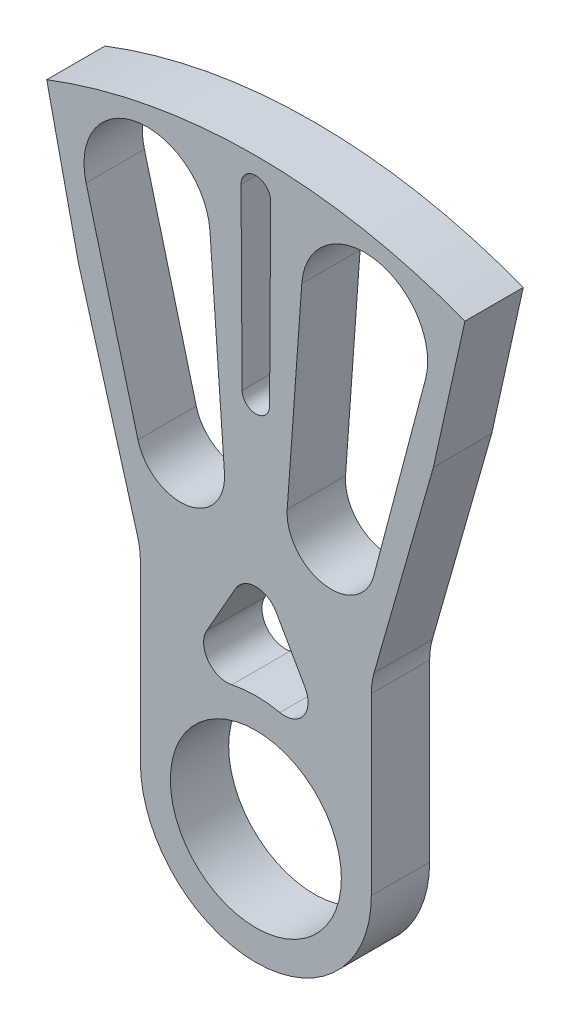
from build123d import *

# Parameters (mm, degrees)
SKETCH2_R          = 9.398
EXTRUDE1_DEPTH     = 3.175
SKETCH8_R          = 9.3091
EXTRUDE2_DEPTH     = 6.35
CUT_EXTRUDE4_DEPTH = 68.756510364
CUT_EXTRUDE5_DEPTH = 68.756510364
CUT_EXTRUDE6_DEPTH = 68.756510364


with BuildPart() as part:
    # Sketch2 → Extrude1 (new, symmetric)
    with BuildSketch(Plane.XY):
        with BuildLine():
            Line((12.573, 13.292251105), (12.573, 0))
            ThreePointArc((12.573, 0), (0, -12.573), (-12.573, 0))
            Line((-12.573, 0), (-12.573, 13.292251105))
            Line((-12.573, 13.292251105), (-22.767788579, 59.27797064))
            ThreePointArc((-22.767788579, 59.27797064), (0, 63.5), (22.767788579, 59.27797064))
            Line((22.767788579, 59.27797064), (12.573, 13.292251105))
        make_face()
        Circle(SKETCH2_R, mode=Mode.SUBTRACT)
    extrude(amount=EXTRUDE1_DEPTH, both=True)

    # Sketch8 → Extrude2 (add)
    with BuildSketch(Plane(origin=(0, 0, -3.175), x_dir=(-1, 0, 0), z_dir=(0, 0, -1))):
        with BuildLine():
            ThreePointArc((-9.398, 0), (0, -9.398), (9.398, 0))
            ThreePointArc((9.398, 0), (0, 9.398), (-9.398, 0))
        make_face()
        Circle(SKETCH8_R, mode=Mode.SUBTRACT)
    extrude(amount=-EXTRUDE2_DEPTH)

    # Sketch9 → Cut-Extrude4 (cut, through all)
    with BuildSketch(Plane.XY.offset(3.175)):
        with BuildLine():
            Line((12.573, 13.292251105), (12.573, 19.05))
            ThreePointArc((12.573, 19.05), (12.646614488, 20.106629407), (12.866035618, 21.142843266))
            Line((12.866035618, 21.142843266), (19.331809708, 43.779271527))
            Line((19.331809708, 43.779271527), (12.573, 13.292251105))
        make_face()
        with BuildLine():
            Line((-12.573, 13.292251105), (-12.573, 19.05))
            ThreePointArc((-12.573, 19.05), (-12.646614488, 20.106629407), (-12.866035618, 21.142843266))
            Line((-12.866035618, 21.142843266), (-19.331809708, 43.779271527))
            Line((-19.331809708, 43.779271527), (-12.573, 13.292251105))
        make_face()
    extrude(amount=-CUT_EXTRUDE4_DEPTH, mode=Mode.SUBTRACT)

    # Sketch10 → Cut-Extrude5 (cut, through all)
    with BuildSketch(Plane.XY.offset(3.175)):
        with BuildLine():
            Line((5.000258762, 53.925776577), (3.415349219, 31.853976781))
            ThreePointArc((3.415349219, 31.853976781), (7.412022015, 26.779491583), (12.836288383, 30.286787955))
            Line((12.836288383, 30.286787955), (18.482355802, 51.683007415))
            ThreePointArc((18.482355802, 51.683007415), (12.972344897, 60.204604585), (5.000258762, 53.925776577))
        make_face()
        with BuildLine():
            Line((-18.482355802, 51.683007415), (-12.836288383, 30.286787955))
            ThreePointArc((-12.836288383, 30.286787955), (-7.412022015, 26.779491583), (-3.415349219, 31.853976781))
            Line((-3.415349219, 31.853976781), (-5.000258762, 53.925776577))
            ThreePointArc((-5.000258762, 53.925776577), (-12.972344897, 60.204604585), (-18.482355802, 51.683007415))
        make_face()
        with BuildLine():
            Line((-1.495828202, 40.630952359), (-1.612969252, 59.997645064))
            ThreePointArc((-1.612969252, 59.997645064), (0, 61.6204), (1.612969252, 59.997645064))
            Line((1.612969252, 59.997645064), (1.495828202, 40.630952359))
            ThreePointArc((1.495828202, 40.630952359), (0, 39.144144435), (-1.495828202, 40.630952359))
        make_face()
    extrude(amount=-CUT_EXTRUDE5_DEPTH, mode=Mode.SUBTRACT)

    # Sketch11 → Cut-Extrude6 (cut, through all)
    with BuildSketch(Plane.XY.offset(3.175)):
        with BuildLine():
            Line((-5.353025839, 16.036431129), (-2.208793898, 21.574125))
            ThreePointArc((-2.208793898, 21.574125), (0, 22.86), (2.208793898, 21.574125))
            Line((2.208793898, 21.574125), (5.353025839, 16.036431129))
            ThreePointArc((5.353025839, 16.036431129), (5.193640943, 13.281798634), (2.615789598, 12.297884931))
            ThreePointArc((2.615789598, 12.297884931), (0, 12.573), (-2.615789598, 12.297884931))
            ThreePointArc((-2.615789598, 12.297884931), (-5.193640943, 13.281798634), (-5.353025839, 16.036431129))
        make_face()
    extrude(amount=-CUT_EXTRUDE6_DEPTH, mode=Mode.SUBTRACT)


solid = part.part
